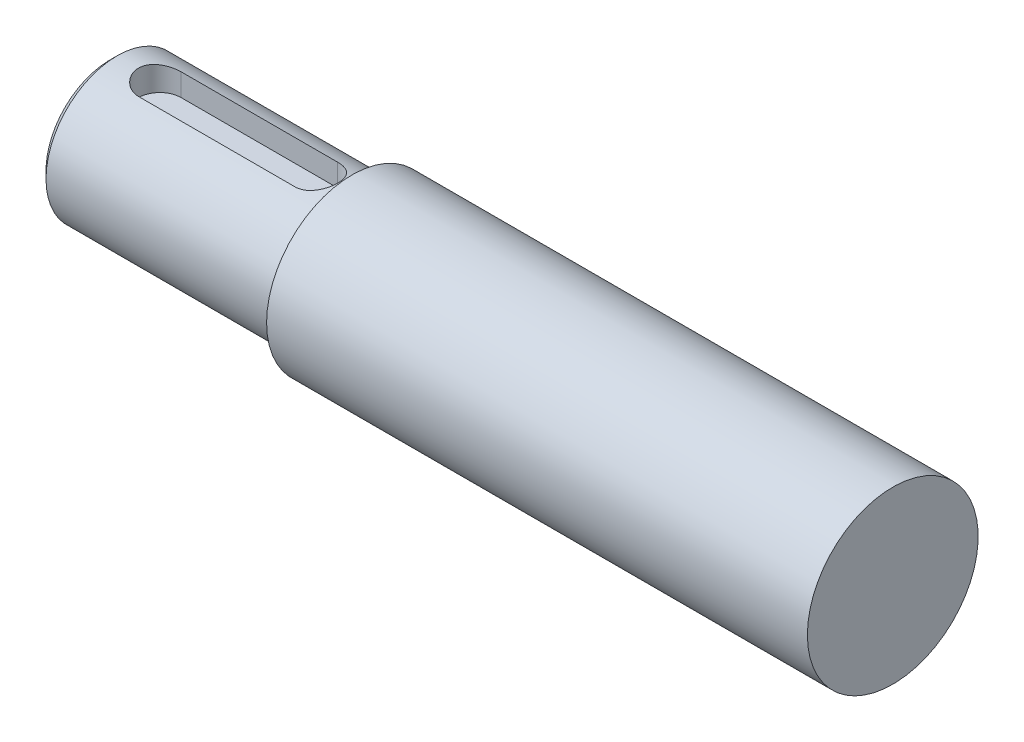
ISO-10303-21;
HEADER;
FILE_DESCRIPTION(('STEP AP214'),'2;1');
FILE_NAME('part.step','',(''),(''),'','','');
FILE_SCHEMA(('AUTOMOTIVE_DESIGN { 1 0 10303 214 1 1 1 1 }'));
ENDSEC;
DATA;
#1=APPLICATION_CONTEXT('core data for automotive mechanical design processes');
#2=APPLICATION_PROTOCOL_DEFINITION('international standard','automotive_design',2000,#1);
#3=PRODUCT_CONTEXT('',#1,'mechanical');
#4=PRODUCT('Part','Part','',(#3));
#5=PRODUCT_RELATED_PRODUCT_CATEGORY('part','',(#4));
#6=PRODUCT_DEFINITION_FORMATION('','',#4);
#7=PRODUCT_DEFINITION_CONTEXT('part definition',#1,'design');
#8=PRODUCT_DEFINITION('design','',#6,#7);
#9=PRODUCT_DEFINITION_SHAPE('','',#8);
#10=(LENGTH_UNIT() NAMED_UNIT(*) SI_UNIT(.MILLI.,.METRE.));
#11=(NAMED_UNIT(*) PLANE_ANGLE_UNIT() SI_UNIT($,.RADIAN.));
#12=(NAMED_UNIT(*) SI_UNIT($,.STERADIAN.) SOLID_ANGLE_UNIT());
#13=UNCERTAINTY_MEASURE_WITH_UNIT(LENGTH_MEASURE(1.E-05),#10,'distance_accuracy_value','');
#14=(GEOMETRIC_REPRESENTATION_CONTEXT(3) GLOBAL_UNCERTAINTY_ASSIGNED_CONTEXT((#13)) GLOBAL_UNIT_ASSIGNED_CONTEXT((#10,
#11,#12)) REPRESENTATION_CONTEXT('',''));
#15=CARTESIAN_POINT('',(0.,0.,0.));
#16=DIRECTION('',(0.,0.,1.));
#17=DIRECTION('',(1.,0.,0.));
#18=AXIS2_PLACEMENT_3D('',#15,#16,#17);
#19=CARTESIAN_POINT('',(0.,0.,0.));
#20=DIRECTION('',(1.,0.,0.));
#21=DIRECTION('',(0.,0.,-1.));
#22=AXIS2_PLACEMENT_3D('',#19,#20,#21);
#23=PLANE('',#22);
#24=CARTESIAN_POINT('',(0.,0.,0.));
#25=DIRECTION('',(-1.,0.,0.));
#26=DIRECTION('',(0.,0.,1.));
#27=AXIS2_PLACEMENT_3D('',#24,#25,#26);
#28=CIRCLE('',#27,2.);
#29=CARTESIAN_POINT('',(0.,0.,2.));
#30=VERTEX_POINT('',#29);
#31=EDGE_CURVE('E96',#30,#30,#28,.T.);
#32=ORIENTED_EDGE('',*,*,#31,.F.);
#33=EDGE_LOOP('',(#32));
#34=FACE_BOUND('',#33,.T.);
#35=CARTESIAN_POINT('',(0.,0.,0.));
#36=DIRECTION('',(1.,0.,0.));
#37=DIRECTION('',(0.,0.,-1.));
#38=AXIS2_PLACEMENT_3D('',#35,#36,#37);
#39=CIRCLE('',#38,4.49999999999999);
#40=CARTESIAN_POINT('',(0.,0.,-4.49999999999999));
#41=VERTEX_POINT('',#40);
#42=EDGE_CURVE('E116',#41,#41,#39,.F.);
#43=ORIENTED_EDGE('',*,*,#42,.T.);
#44=EDGE_LOOP('',(#43));
#45=FACE_BOUND('',#44,.T.);
#46=ADVANCED_FACE('F33',(#34,#45),#23,.F.);
#47=CARTESIAN_POINT('',(0.,0.,0.));
#48=DIRECTION('',(-1.,0.,0.));
#49=DIRECTION('',(0.,0.,1.));
#50=AXIS2_PLACEMENT_3D('',#47,#48,#49);
#51=CYLINDRICAL_SURFACE('',#50,5.);
#52=DIRECTION('',(-1.,0.,0.));
#53=VECTOR('',#52,1.);
#54=CARTESIAN_POINT('',(0.,4.76969600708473,-1.5));
#55=LINE('',#54,#53);
#56=CARTESIAN_POINT('',(3.5,4.76969600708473,-1.5));
#57=VERTEX_POINT('',#56);
#58=CARTESIAN_POINT('',(14.5,4.76969600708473,-1.5));
#59=VERTEX_POINT('',#58);
#60=EDGE_CURVE('E11',#57,#59,#55,.F.);
#61=ORIENTED_EDGE('',*,*,#60,.T.);
#62=CARTESIAN_POINT('',(14.5,4.76969600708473,-1.5));
#63=CARTESIAN_POINT('',(14.541179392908,4.76969249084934,-1.50000085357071));
#64=CARTESIAN_POINT('',(14.5823380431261,4.77022997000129,-1.49830317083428));
#65=CARTESIAN_POINT('',(14.6643411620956,4.77235095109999,-1.49153785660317));
#66=CARTESIAN_POINT('',(14.7051856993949,4.77393421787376,-1.48647098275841));
#67=CARTESIAN_POINT('',(14.8265905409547,4.78018490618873,-1.46630203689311));
#68=CARTESIAN_POINT('',(14.9063063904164,4.78635370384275,-1.44623120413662));
#69=CARTESIAN_POINT('',(15.0610355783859,4.80195952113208,-1.39353102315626));
#70=CARTESIAN_POINT('',(15.1360505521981,4.81139539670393,-1.36090607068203));
#71=CARTESIAN_POINT('',(15.2795966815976,4.83246571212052,-1.28407841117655));
#72=CARTESIAN_POINT('',(15.3481247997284,4.84410117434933,-1.23987031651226));
#73=CARTESIAN_POINT('',(15.4788660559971,4.86866835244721,-1.13964850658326));
#74=CARTESIAN_POINT('',(15.5408436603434,4.88162755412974,-1.08333433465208));
#75=CARTESIAN_POINT('',(15.6546355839,4.90714811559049,-0.961138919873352));
#76=CARTESIAN_POINT('',(15.7064481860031,4.91970940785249,-0.895256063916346));
#77=CARTESIAN_POINT('',(15.7994637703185,4.94333239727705,-0.754109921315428));
#78=CARTESIAN_POINT('',(15.840425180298,4.95435770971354,-0.678680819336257));
#79=CARTESIAN_POINT('',(15.9089884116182,4.97334469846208,-0.521621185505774));
#80=CARTESIAN_POINT('',(15.9365936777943,4.98130716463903,-0.439992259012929));
#81=CARTESIAN_POINT('',(15.9768797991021,4.99307639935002,-0.27532469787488));
#82=CARTESIAN_POINT('',(15.9899648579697,4.99699549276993,-0.192393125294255));
#83=CARTESIAN_POINT('',(16.0021173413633,5.00063202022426,-0.0254235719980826));
#84=CARTESIAN_POINT('',(16.0011874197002,5.00035024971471,0.0586141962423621));
#85=CARTESIAN_POINT('',(15.985607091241,4.99569602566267,0.222571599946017));
#86=CARTESIAN_POINT('',(15.9713946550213,4.99145415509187,0.302537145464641));
#87=CARTESIAN_POINT('',(15.9303683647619,4.9795151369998,0.458890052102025));
#88=CARTESIAN_POINT('',(15.9035538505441,4.97181780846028,0.535277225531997));
#89=CARTESIAN_POINT('',(15.8377877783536,4.95365214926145,0.683347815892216));
#90=CARTESIAN_POINT('',(15.7986983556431,4.94315255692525,0.754966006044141));
#91=CARTESIAN_POINT('',(15.7096014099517,4.92049624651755,0.89076552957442));
#92=CARTESIAN_POINT('',(15.6595914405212,4.90833915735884,0.954945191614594));
#93=CARTESIAN_POINT('',(15.5478080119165,4.88311673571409,1.07665450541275));
#94=CARTESIAN_POINT('',(15.4856561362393,4.87003445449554,1.13383351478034));
#95=CARTESIAN_POINT('',(15.3525025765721,4.84484215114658,1.23706769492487));
#96=CARTESIAN_POINT('',(15.2814983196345,4.83273241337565,1.28311962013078));
#97=CARTESIAN_POINT('',(15.1317190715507,4.81077228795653,1.36316407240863));
#98=CARTESIAN_POINT('',(15.0528728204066,4.80094596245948,1.39703006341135));
#99=CARTESIAN_POINT('',(14.8902754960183,4.78495663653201,1.45085886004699));
#100=CARTESIAN_POINT('',(14.8065321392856,4.77878803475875,1.47084293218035));
#101=CARTESIAN_POINT('',(14.6850051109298,4.77314032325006,1.4890120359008));
#102=CARTESIAN_POINT('',(14.6481092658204,4.77185156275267,1.49313202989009));
#103=CARTESIAN_POINT('',(14.5741485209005,4.77012928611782,1.49862355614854));
#104=CARTESIAN_POINT('',(14.5370839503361,4.76969451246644,1.49999912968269));
#105=CARTESIAN_POINT('',(14.5,4.76969600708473,1.5));
#106=B_SPLINE_CURVE_WITH_KNOTS('',3,(#62,#63,#64,#65,#66,#67,#68,#69,#70,#71,#72,#73,#74,#75,
#76,#77,#78,#79,#80,#81,#82,#83,#84,#85,#86,#87,#88,#89,#90,#91,#92,#93,#94,#95,#96,#97,#98,#99,
#100,#101,#102,#103,#104,#105),.UNSPECIFIED.,.F.,.F.,(4,2,2,2,2,2,2,2,2,2,2,2,2,2,2,2,2,2,2,2,2,
4),(0.,0.123459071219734,0.246890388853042,0.49291134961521,0.738846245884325,0.984895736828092,
1.23795510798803,1.49105719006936,1.74939356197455,2.00766326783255,2.25854751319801,
2.5093842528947,2.75223130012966,2.99509107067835,3.2407824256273,3.48652887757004,
3.74172568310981,3.99699683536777,4.25484698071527,4.51230123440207,4.62365084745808,
4.73483637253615),.UNSPECIFIED.);
#107=CARTESIAN_POINT('',(14.5,4.76969600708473,1.5));
#108=VERTEX_POINT('',#107);
#109=EDGE_CURVE('E122',#59,#108,#106,.T.);
#110=ORIENTED_EDGE('',*,*,#109,.T.);
#111=DIRECTION('',(-1.,0.,0.));
#112=VECTOR('',#111,1.);
#113=CARTESIAN_POINT('',(0.,4.76969600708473,1.5));
#114=LINE('',#113,#112);
#115=CARTESIAN_POINT('',(3.5,4.76969600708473,1.5));
#116=VERTEX_POINT('',#115);
#117=EDGE_CURVE('E41',#108,#116,#114,.T.);
#118=ORIENTED_EDGE('',*,*,#117,.T.);
#119=CARTESIAN_POINT('',(3.5,4.76969600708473,1.5));
#120=CARTESIAN_POINT('',(3.45882060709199,4.76969249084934,1.50000085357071));
#121=CARTESIAN_POINT('',(3.41766195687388,4.77022997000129,1.49830317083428));
#122=CARTESIAN_POINT('',(3.33565883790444,4.77235095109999,1.49153785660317));
#123=CARTESIAN_POINT('',(3.29481430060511,4.77393421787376,1.48647098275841));
#124=CARTESIAN_POINT('',(3.17340945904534,4.78018490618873,1.46630203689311));
#125=CARTESIAN_POINT('',(3.09369360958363,4.78635370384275,1.44623120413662));
#126=CARTESIAN_POINT('',(2.93896442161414,4.80195952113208,1.39353102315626));
#127=CARTESIAN_POINT('',(2.86394944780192,4.81139539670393,1.36090607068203));
#128=CARTESIAN_POINT('',(2.7204033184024,4.83246571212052,1.28407841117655));
#129=CARTESIAN_POINT('',(2.65187520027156,4.84410117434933,1.23987031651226));
#130=CARTESIAN_POINT('',(2.52113394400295,4.86866835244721,1.13964850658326));
#131=CARTESIAN_POINT('',(2.4591563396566,4.88162755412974,1.08333433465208));
#132=CARTESIAN_POINT('',(2.34536441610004,4.90714811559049,0.961138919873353));
#133=CARTESIAN_POINT('',(2.29355181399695,4.91970940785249,0.895256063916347));
#134=CARTESIAN_POINT('',(2.20053622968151,4.94333239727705,0.754109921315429));
#135=CARTESIAN_POINT('',(2.15957481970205,4.95435770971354,0.678680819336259));
#136=CARTESIAN_POINT('',(2.09101158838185,4.97334469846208,0.521621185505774));
#137=CARTESIAN_POINT('',(2.06340632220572,4.98130716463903,0.439992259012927));
#138=CARTESIAN_POINT('',(2.02312020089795,4.99307639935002,0.275324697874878));
#139=CARTESIAN_POINT('',(2.01003514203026,4.99699549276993,0.192393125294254));
#140=CARTESIAN_POINT('',(1.99788265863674,5.00063202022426,0.0254235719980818));
#141=CARTESIAN_POINT('',(1.99881258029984,5.00035024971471,-0.0586141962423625));
#142=CARTESIAN_POINT('',(2.014392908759,4.99569602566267,-0.222571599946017));
#143=CARTESIAN_POINT('',(2.02860534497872,4.99145415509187,-0.302537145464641));
#144=CARTESIAN_POINT('',(2.06963163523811,4.9795151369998,-0.458890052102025));
#145=CARTESIAN_POINT('',(2.09644614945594,4.97181780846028,-0.535277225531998));
#146=CARTESIAN_POINT('',(2.16221222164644,4.95365214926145,-0.683347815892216));
#147=CARTESIAN_POINT('',(2.20130164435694,4.94315255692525,-0.754966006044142));
#148=CARTESIAN_POINT('',(2.29039859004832,4.92049624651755,-0.89076552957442));
#149=CARTESIAN_POINT('',(2.34040855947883,4.90833915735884,-0.954945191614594));
#150=CARTESIAN_POINT('',(2.45219198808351,4.88311673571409,-1.07665450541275));
#151=CARTESIAN_POINT('',(2.51434386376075,4.87003445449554,-1.13383351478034));
#152=CARTESIAN_POINT('',(2.64749742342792,4.84484215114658,-1.23706769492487));
#153=CARTESIAN_POINT('',(2.71850168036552,4.83273241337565,-1.28311962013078));
#154=CARTESIAN_POINT('',(2.86828092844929,4.81077228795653,-1.36316407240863));
#155=CARTESIAN_POINT('',(2.9471271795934,4.80094596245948,-1.39703006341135));
#156=CARTESIAN_POINT('',(3.10972450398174,4.78495663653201,-1.45085886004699));
#157=CARTESIAN_POINT('',(3.19346786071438,4.77878803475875,-1.47084293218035));
#158=CARTESIAN_POINT('',(3.31499488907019,4.77314032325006,-1.4890120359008));
#159=CARTESIAN_POINT('',(3.35189073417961,4.77185156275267,-1.49313202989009));
#160=CARTESIAN_POINT('',(3.42585147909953,4.77012928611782,-1.49862355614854));
#161=CARTESIAN_POINT('',(3.46291604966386,4.76969451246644,-1.49999912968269));
#162=CARTESIAN_POINT('',(3.5,4.76969600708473,-1.5));
#163=B_SPLINE_CURVE_WITH_KNOTS('',3,(#119,#120,#121,#122,#123,#124,#125,#126,#127,#128,#129,
#130,#131,#132,#133,#134,#135,#136,#137,#138,#139,#140,#141,#142,#143,#144,#145,#146,#147,#148,
#149,#150,#151,#152,#153,#154,#155,#156,#157,#158,#159,#160,#161,#162),.UNSPECIFIED.,.F.,.F.,(4,
2,2,2,2,2,2,2,2,2,2,2,2,2,2,2,2,2,2,2,2,4),(0.,0.123459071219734,0.246890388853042,
0.492911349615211,0.738846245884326,0.984895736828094,1.23795510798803,1.49105719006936,
1.74939356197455,2.00766326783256,2.25854751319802,2.5093842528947,2.75223130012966,
2.99509107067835,3.2407824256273,3.48652887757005,3.74172568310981,3.99699683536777,
4.25484698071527,4.51230123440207,4.62365084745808,4.73483637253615),.UNSPECIFIED.);
#164=EDGE_CURVE('E48',#116,#57,#163,.T.);
#165=ORIENTED_EDGE('',*,*,#164,.T.);
#166=EDGE_LOOP('',(#61,#110,#118,#165));
#167=FACE_BOUND('',#166,.T.);
#168=CARTESIAN_POINT('',(0.500000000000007,0.,0.));
#169=DIRECTION('',(1.,0.,0.));
#170=DIRECTION('',(0.,0.,-1.));
#171=AXIS2_PLACEMENT_3D('',#168,#169,#170);
#172=CIRCLE('',#171,5.);
#173=CARTESIAN_POINT('',(0.500000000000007,0.,-5.));
#174=VERTEX_POINT('',#173);
#175=EDGE_CURVE('E119',#174,#174,#172,.T.);
#176=ORIENTED_EDGE('',*,*,#175,.T.);
#177=EDGE_LOOP('',(#176));
#178=FACE_BOUND('',#177,.T.);
#179=CARTESIAN_POINT('',(17.,0.,0.));
#180=DIRECTION('',(-1.,0.,0.));
#181=DIRECTION('',(0.,0.,1.));
#182=AXIS2_PLACEMENT_3D('',#179,#180,#181);
#183=CIRCLE('',#182,5.);
#184=CARTESIAN_POINT('',(17.,0.,5.));
#185=VERTEX_POINT('',#184);
#186=EDGE_CURVE('E113',#185,#185,#183,.T.);
#187=ORIENTED_EDGE('',*,*,#186,.T.);
#188=EDGE_LOOP('',(#187));
#189=FACE_BOUND('',#188,.T.);
#190=ADVANCED_FACE('F134',(#167,#178,#189),#51,.T.);
#191=CARTESIAN_POINT('',(17.,5.,0.));
#192=DIRECTION('',(1.,0.,0.));
#193=DIRECTION('',(0.,0.,-1.));
#194=AXIS2_PLACEMENT_3D('',#191,#192,#193);
#195=PLANE('',#194);
#196=ORIENTED_EDGE('',*,*,#186,.F.);
#197=EDGE_LOOP('',(#196));
#198=FACE_BOUND('',#197,.T.);
#199=CARTESIAN_POINT('',(17.,0.,0.));
#200=DIRECTION('',(-1.,0.,0.));
#201=DIRECTION('',(0.,0.,1.));
#202=AXIS2_PLACEMENT_3D('',#199,#200,#201);
#203=CIRCLE('',#202,6.);
#204=CARTESIAN_POINT('',(17.,0.,6.));
#205=VERTEX_POINT('',#204);
#206=EDGE_CURVE('E110',#205,#205,#203,.T.);
#207=ORIENTED_EDGE('',*,*,#206,.T.);
#208=EDGE_LOOP('',(#207));
#209=FACE_BOUND('',#208,.T.);
#210=ADVANCED_FACE('F155',(#198,#209),#195,.F.);
#211=CARTESIAN_POINT('',(0.,0.,0.));
#212=DIRECTION('',(-1.,0.,0.));
#213=DIRECTION('',(0.,0.,1.));
#214=AXIS2_PLACEMENT_3D('',#211,#212,#213);
#215=CYLINDRICAL_SURFACE('',#214,6.);
#216=ORIENTED_EDGE('',*,*,#206,.F.);
#217=EDGE_LOOP('',(#216));
#218=FACE_BOUND('',#217,.T.);
#219=CARTESIAN_POINT('',(55.,0.,0.));
#220=DIRECTION('',(-1.,0.,0.));
#221=DIRECTION('',(0.,0.,1.));
#222=AXIS2_PLACEMENT_3D('',#219,#220,#221);
#223=CIRCLE('',#222,6.);
#224=CARTESIAN_POINT('',(55.,0.,6.));
#225=VERTEX_POINT('',#224);
#226=EDGE_CURVE('E104',#225,#225,#223,.T.);
#227=ORIENTED_EDGE('',*,*,#226,.T.);
#228=EDGE_LOOP('',(#227));
#229=FACE_BOUND('',#228,.T.);
#230=ADVANCED_FACE('F152',(#218,#229),#215,.T.);
#231=CARTESIAN_POINT('',(55.,6.,0.));
#232=DIRECTION('',(-1.,0.,0.));
#233=DIRECTION('',(0.,0.,1.));
#234=AXIS2_PLACEMENT_3D('',#231,#232,#233);
#235=PLANE('',#234);
#236=ORIENTED_EDGE('',*,*,#226,.F.);
#237=EDGE_LOOP('',(#236));
#238=FACE_BOUND('',#237,.T.);
#239=ADVANCED_FACE('F149',(#238),#235,.F.);
#240=CARTESIAN_POINT('',(0.,0.,0.));
#241=DIRECTION('',(1.,0.,0.));
#242=DIRECTION('',(0.,0.,-1.));
#243=AXIS2_PLACEMENT_3D('',#240,#241,#242);
#244=CONICAL_SURFACE('',#243,4.49999999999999,0.785398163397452);
#245=ORIENTED_EDGE('',*,*,#175,.F.);
#246=EDGE_LOOP('',(#245));
#247=FACE_BOUND('',#246,.T.);
#248=ORIENTED_EDGE('',*,*,#42,.F.);
#249=EDGE_LOOP('',(#248));
#250=FACE_BOUND('',#249,.T.);
#251=ADVANCED_FACE('F35',(#247,#250),#244,.T.);
#252=CARTESIAN_POINT('',(3.5,3.2,0.));
#253=DIRECTION('',(0.,1.,0.));
#254=DIRECTION('',(0.,0.,1.));
#255=AXIS2_PLACEMENT_3D('',#252,#253,#254);
#256=CYLINDRICAL_SURFACE('',#255,1.5);
#257=DIRECTION('',(0.,1.,0.));
#258=VECTOR('',#257,1.);
#259=CARTESIAN_POINT('',(3.5,3.2,1.5));
#260=LINE('',#259,#258);
#261=CARTESIAN_POINT('',(3.5,3.2,1.5));
#262=VERTEX_POINT('',#261);
#263=EDGE_CURVE('E71',#262,#116,#260,.T.);
#264=ORIENTED_EDGE('',*,*,#263,.F.);
#265=CARTESIAN_POINT('',(3.5,3.2,0.));
#266=DIRECTION('',(0.,1.,0.));
#267=DIRECTION('',(0.,0.,1.));
#268=AXIS2_PLACEMENT_3D('',#265,#266,#267);
#269=CIRCLE('',#268,1.5);
#270=CARTESIAN_POINT('',(3.5,3.2,-1.5));
#271=VERTEX_POINT('',#270);
#272=EDGE_CURVE('E75',#271,#262,#269,.T.);
#273=ORIENTED_EDGE('',*,*,#272,.F.);
#274=DIRECTION('',(0.,1.,0.));
#275=VECTOR('',#274,1.);
#276=CARTESIAN_POINT('',(3.5,3.2,-1.5));
#277=LINE('',#276,#275);
#278=EDGE_CURVE('E102',#271,#57,#277,.T.);
#279=ORIENTED_EDGE('',*,*,#278,.T.);
#280=ORIENTED_EDGE('',*,*,#164,.F.);
#281=EDGE_LOOP('',(#264,#273,#279,#280));
#282=FACE_BOUND('',#281,.T.);
#283=ADVANCED_FACE('F73',(#282),#256,.F.);
#284=CARTESIAN_POINT('',(3.5,3.2,-1.5));
#285=DIRECTION('',(0.,0.,-1.));
#286=DIRECTION('',(-1.,0.,0.));
#287=AXIS2_PLACEMENT_3D('',#284,#285,#286);
#288=PLANE('',#287);
#289=ORIENTED_EDGE('',*,*,#278,.F.);
#290=DIRECTION('',(-1.,0.,0.));
#291=VECTOR('',#290,1.);
#292=CARTESIAN_POINT('',(3.5,3.2,-1.5));
#293=LINE('',#292,#291);
#294=CARTESIAN_POINT('',(14.5,3.2,-1.5));
#295=VERTEX_POINT('',#294);
#296=EDGE_CURVE('E80',#295,#271,#293,.T.);
#297=ORIENTED_EDGE('',*,*,#296,.F.);
#298=DIRECTION('',(0.,1.,0.));
#299=VECTOR('',#298,1.);
#300=CARTESIAN_POINT('',(14.5,3.2,-1.5));
#301=LINE('',#300,#299);
#302=EDGE_CURVE('E105',#295,#59,#301,.T.);
#303=ORIENTED_EDGE('',*,*,#302,.T.);
#304=ORIENTED_EDGE('',*,*,#60,.F.);
#305=EDGE_LOOP('',(#289,#297,#303,#304));
#306=FACE_BOUND('',#305,.T.);
#307=ADVANCED_FACE('F142',(#306),#288,.F.);
#308=CARTESIAN_POINT('',(14.5,3.2,0.));
#309=DIRECTION('',(0.,1.,0.));
#310=DIRECTION('',(0.,0.,1.));
#311=AXIS2_PLACEMENT_3D('',#308,#309,#310);
#312=CYLINDRICAL_SURFACE('',#311,1.5);
#313=ORIENTED_EDGE('',*,*,#302,.F.);
#314=CARTESIAN_POINT('',(14.5,3.2,0.));
#315=DIRECTION('',(0.,1.,0.));
#316=DIRECTION('',(0.,0.,1.));
#317=AXIS2_PLACEMENT_3D('',#314,#315,#316);
#318=CIRCLE('',#317,1.5);
#319=CARTESIAN_POINT('',(14.5,3.2,1.5));
#320=VERTEX_POINT('',#319);
#321=EDGE_CURVE('E89',#320,#295,#318,.T.);
#322=ORIENTED_EDGE('',*,*,#321,.F.);
#323=DIRECTION('',(0.,1.,0.));
#324=VECTOR('',#323,1.);
#325=CARTESIAN_POINT('',(14.5,3.2,1.5));
#326=LINE('',#325,#324);
#327=EDGE_CURVE('E79',#320,#108,#326,.T.);
#328=ORIENTED_EDGE('',*,*,#327,.T.);
#329=ORIENTED_EDGE('',*,*,#109,.F.);
#330=EDGE_LOOP('',(#313,#322,#328,#329));
#331=FACE_BOUND('',#330,.T.);
#332=ADVANCED_FACE('F137',(#331),#312,.F.);
#333=CARTESIAN_POINT('',(3.5,3.2,1.5));
#334=DIRECTION('',(0.,0.,1.));
#335=DIRECTION('',(1.,0.,0.));
#336=AXIS2_PLACEMENT_3D('',#333,#334,#335);
#337=PLANE('',#336);
#338=ORIENTED_EDGE('',*,*,#327,.F.);
#339=DIRECTION('',(1.,0.,0.));
#340=VECTOR('',#339,1.);
#341=CARTESIAN_POINT('',(3.5,3.2,1.5));
#342=LINE('',#341,#340);
#343=EDGE_CURVE('E83',#262,#320,#342,.T.);
#344=ORIENTED_EDGE('',*,*,#343,.F.);
#345=ORIENTED_EDGE('',*,*,#263,.T.);
#346=ORIENTED_EDGE('',*,*,#117,.F.);
#347=EDGE_LOOP('',(#338,#344,#345,#346));
#348=FACE_BOUND('',#347,.T.);
#349=ADVANCED_FACE('F84',(#348),#337,.F.);
#350=CARTESIAN_POINT('',(3.5,3.2,0.));
#351=DIRECTION('',(0.,1.,0.));
#352=DIRECTION('',(0.,0.,1.));
#353=AXIS2_PLACEMENT_3D('',#350,#351,#352);
#354=PLANE('',#353);
#355=ORIENTED_EDGE('',*,*,#272,.T.);
#356=ORIENTED_EDGE('',*,*,#343,.T.);
#357=ORIENTED_EDGE('',*,*,#321,.T.);
#358=ORIENTED_EDGE('',*,*,#296,.T.);
#359=EDGE_LOOP('',(#355,#356,#357,#358));
#360=FACE_BOUND('',#359,.T.);
#361=ADVANCED_FACE('F91',(#360),#354,.T.);
#362=CARTESIAN_POINT('',(10.,0.,0.));
#363=DIRECTION('',(-1.,0.,0.));
#364=DIRECTION('',(0.,0.,1.));
#365=AXIS2_PLACEMENT_3D('',#362,#363,#364);
#366=CYLINDRICAL_SURFACE('',#365,2.);
#367=CARTESIAN_POINT('',(10.,0.,0.));
#368=DIRECTION('',(-1.,0.,0.));
#369=DIRECTION('',(0.,0.,1.));
#370=AXIS2_PLACEMENT_3D('',#367,#368,#369);
#371=CIRCLE('',#370,2.);
#372=CARTESIAN_POINT('',(10.,0.,2.));
#373=VERTEX_POINT('',#372);
#374=EDGE_CURVE('E93',#373,#373,#371,.T.);
#375=ORIENTED_EDGE('',*,*,#374,.F.);
#376=EDGE_LOOP('',(#375));
#377=FACE_BOUND('',#376,.T.);
#378=ORIENTED_EDGE('',*,*,#31,.T.);
#379=EDGE_LOOP('',(#378));
#380=FACE_BOUND('',#379,.T.);
#381=ADVANCED_FACE('F208',(#377,#380),#366,.F.);
#382=CARTESIAN_POINT('',(10.,0.,0.));
#383=DIRECTION('',(-1.,0.,0.));
#384=DIRECTION('',(0.,0.,1.));
#385=AXIS2_PLACEMENT_3D('',#382,#383,#384);
#386=PLANE('',#385);
#387=ORIENTED_EDGE('',*,*,#374,.T.);
#388=EDGE_LOOP('',(#387));
#389=FACE_BOUND('',#388,.T.);
#390=ADVANCED_FACE('F213',(#389),#386,.T.);
#391=CLOSED_SHELL('',(#46,#190,#210,#230,#239,#251,#283,#307,#332,#349,#361,#381,#390));
#392=MANIFOLD_SOLID_BREP('B2',#391);
#393=ADVANCED_BREP_SHAPE_REPRESENTATION('',(#18,#392),#14);
#394=SHAPE_DEFINITION_REPRESENTATION(#9,#393);
ENDSEC;
END-ISO-10303-21;
